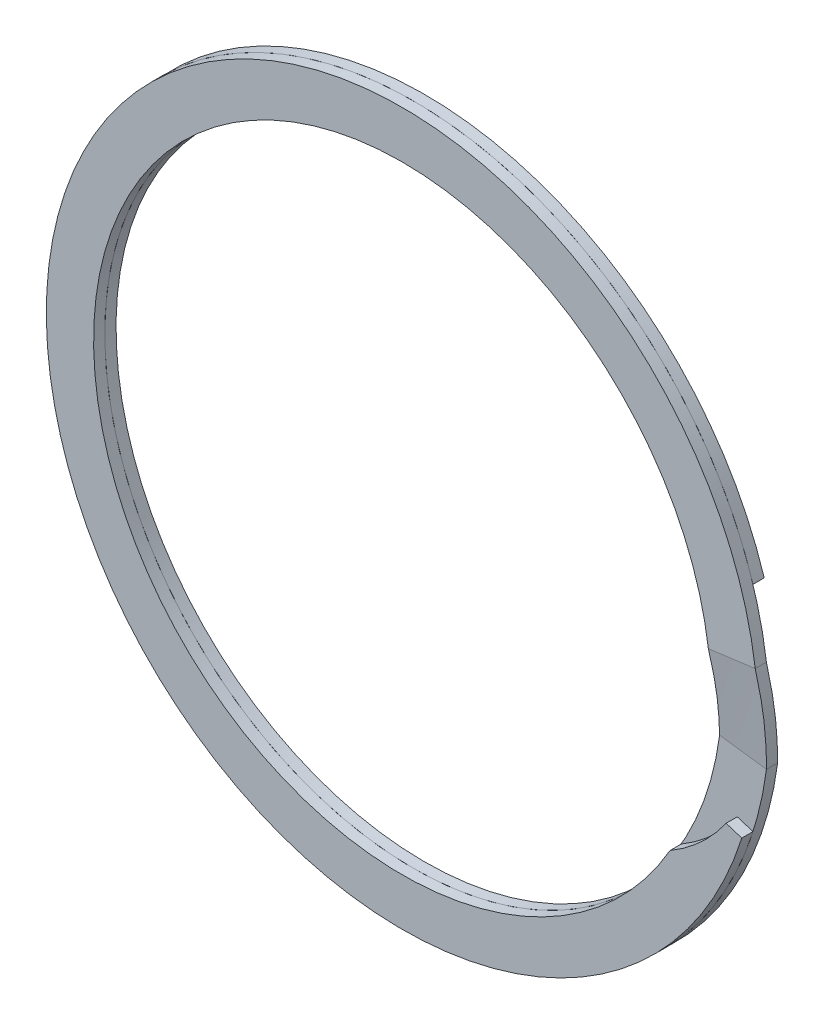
ISO-10303-21;
HEADER;
FILE_DESCRIPTION(('STEP AP214'),'2;1');
FILE_NAME('part.step','',(''),(''),'','','');
FILE_SCHEMA(('AUTOMOTIVE_DESIGN { 1 0 10303 214 1 1 1 1 }'));
ENDSEC;
DATA;
#1=APPLICATION_CONTEXT('core data for automotive mechanical design processes');
#2=APPLICATION_PROTOCOL_DEFINITION('international standard','automotive_design',2000,#1);
#3=PRODUCT_CONTEXT('',#1,'mechanical');
#4=PRODUCT('Part','Part','',(#3));
#5=PRODUCT_RELATED_PRODUCT_CATEGORY('part','',(#4));
#6=PRODUCT_DEFINITION_FORMATION('','',#4);
#7=PRODUCT_DEFINITION_CONTEXT('part definition',#1,'design');
#8=PRODUCT_DEFINITION('design','',#6,#7);
#9=PRODUCT_DEFINITION_SHAPE('','',#8);
#10=(LENGTH_UNIT() NAMED_UNIT(*) SI_UNIT(.MILLI.,.METRE.));
#11=(NAMED_UNIT(*) PLANE_ANGLE_UNIT() SI_UNIT($,.RADIAN.));
#12=(NAMED_UNIT(*) SI_UNIT($,.STERADIAN.) SOLID_ANGLE_UNIT());
#13=UNCERTAINTY_MEASURE_WITH_UNIT(LENGTH_MEASURE(1.E-05),#10,'distance_accuracy_value','');
#14=(GEOMETRIC_REPRESENTATION_CONTEXT(3) GLOBAL_UNCERTAINTY_ASSIGNED_CONTEXT((#13)) GLOBAL_UNIT_ASSIGNED_CONTEXT((#10,
#11,#12)) REPRESENTATION_CONTEXT('',''));
#15=CARTESIAN_POINT('',(0.,0.,0.));
#16=DIRECTION('',(0.,0.,1.));
#17=DIRECTION('',(1.,0.,0.));
#18=AXIS2_PLACEMENT_3D('',#15,#16,#17);
#19=CARTESIAN_POINT('',(32.8862260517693,4.32955379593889,-0.00254));
#20=DIRECTION('',(0.,0.,-1.));
#21=DIRECTION('',(-1.,0.,0.));
#22=AXIS2_PLACEMENT_3D('',#19,#20,#21);
#23=PLANE('',#22);
#24=CARTESIAN_POINT('',(19.125,0.,-0.00254000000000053));
#25=DIRECTION('',(0.,0.,-1.));
#26=DIRECTION('',(-1.,0.,0.));
#27=AXIS2_PLACEMENT_3D('',#24,#25,#26);
#28=CIRCLE('',#27,19.125);
#29=CARTESIAN_POINT('',(34.7912828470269,10.9696493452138,-0.00254000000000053));
#30=VERTEX_POINT('',#29);
#31=CARTESIAN_POINT('',(28.764677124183,16.5179372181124,-0.00254));
#32=VERTEX_POINT('',#31);
#33=EDGE_CURVE('E111',#30,#32,#28,.F.);
#34=ORIENTED_EDGE('',*,*,#33,.F.);
#35=DIRECTION('',(-0.953716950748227,-0.300705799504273,0.));
#36=VECTOR('',#35,1.);
#37=CARTESIAN_POINT('',(34.7912828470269,10.9696493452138,-0.00254000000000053));
#38=LINE('',#37,#36);
#39=CARTESIAN_POINT('',(36.4796733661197,11.5019968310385,-0.00254000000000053));
#40=VERTEX_POINT('',#39);
#41=EDGE_CURVE('E419',#40,#30,#38,.T.);
#42=ORIENTED_EDGE('',*,*,#41,.F.);
#43=CARTESIAN_POINT('',(0.,0.,-0.00254));
#44=DIRECTION('',(0.,0.,1.));
#45=DIRECTION('',(1.,0.,0.));
#46=AXIS2_PLACEMENT_3D('',#43,#44,#45);
#47=CIRCLE('',#46,38.25);
#48=CARTESIAN_POINT('',(37.9227659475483,-4.99262685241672,-0.00254));
#49=VERTEX_POINT('',#48);
#50=EDGE_CURVE('E14',#40,#49,#47,.T.);
#51=ORIENTED_EDGE('',*,*,#50,.T.);
#52=CARTESIAN_POINT('',(32.8862260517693,-4.32955379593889,-0.00254));
#53=CARTESIAN_POINT('',(34.5650726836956,-4.55057814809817,-0.00254));
#54=CARTESIAN_POINT('',(36.243919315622,-4.77160250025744,-0.00254));
#55=CARTESIAN_POINT('',(37.9227659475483,-4.99262685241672,-0.00254));
#56=B_SPLINE_CURVE_WITH_KNOTS('',3,(#52,#53,#54,#55),.UNSPECIFIED.,.F.,.F.,(4,4),(0.,1.),.UNSPECIFIED.);
#57=CARTESIAN_POINT('',(32.8862260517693,-4.32955379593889,-0.00254));
#58=VERTEX_POINT('',#57);
#59=EDGE_CURVE('E241',#49,#58,#56,.F.);
#60=ORIENTED_EDGE('',*,*,#59,.T.);
#61=CARTESIAN_POINT('',(0.,0.,-0.00254));
#62=DIRECTION('',(0.,0.,1.));
#63=DIRECTION('',(1.,0.,0.));
#64=AXIS2_PLACEMENT_3D('',#61,#62,#63);
#65=CIRCLE('',#64,33.17);
#66=EDGE_CURVE('E172',#32,#58,#65,.T.);
#67=ORIENTED_EDGE('',*,*,#66,.F.);
#68=EDGE_LOOP('',(#34,#42,#51,#60,#67));
#69=FACE_BOUND('',#68,.T.);
#70=ADVANCED_FACE('F94',(#69),#23,.F.);
#71=CARTESIAN_POINT('',(0.,0.,0.));
#72=DIRECTION('',(0.,0.,1.));
#73=DIRECTION('',(1.,0.,0.));
#74=AXIS2_PLACEMENT_3D('',#71,#72,#73);
#75=CYLINDRICAL_SURFACE('',#74,38.25);
#76=ORIENTED_EDGE('',*,*,#50,.F.);
#77=DIRECTION('',(0.,0.,-1.));
#78=VECTOR('',#77,1.);
#79=CARTESIAN_POINT('',(36.4796733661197,11.5019968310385,15.2430259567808));
#80=LINE('',#79,#78);
#81=CARTESIAN_POINT('',(36.4796733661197,11.5019968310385,-1.205));
#82=VERTEX_POINT('',#81);
#83=EDGE_CURVE('E422',#40,#82,#80,.T.);
#84=ORIENTED_EDGE('',*,*,#83,.T.);
#85=CARTESIAN_POINT('',(0.,0.,-1.205));
#86=DIRECTION('',(0.,0.,1.));
#87=DIRECTION('',(1.,0.,0.));
#88=AXIS2_PLACEMENT_3D('',#85,#86,#87);
#89=CIRCLE('',#88,38.25);
#90=CARTESIAN_POINT('',(37.9227659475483,-4.99262685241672,-1.205));
#91=VERTEX_POINT('',#90);
#92=EDGE_CURVE('E104',#82,#91,#89,.T.);
#93=ORIENTED_EDGE('',*,*,#92,.T.);
#94=CARTESIAN_POINT('',(37.9227659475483,-4.99262685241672,-0.00254));
#95=CARTESIAN_POINT('',(37.9227659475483,-4.99262685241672,-0.102745));
#96=CARTESIAN_POINT('',(37.9227659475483,-4.99262685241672,-0.303155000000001));
#97=CARTESIAN_POINT('',(37.9227659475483,-4.99262685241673,-0.603769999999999));
#98=CARTESIAN_POINT('',(37.9227659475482,-4.99262685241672,-0.904385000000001));
#99=CARTESIAN_POINT('',(37.9227659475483,-4.99262685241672,-1.104795));
#100=CARTESIAN_POINT('',(37.9227659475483,-4.99262685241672,-1.205));
#101=B_SPLINE_CURVE_WITH_KNOTS('',3,(#94,#95,#96,#97,#98,#99,#100),.UNSPECIFIED.,.F.,.F.,(4,1,1,
1,4),(0.839348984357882,0.879511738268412,0.919674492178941,0.959837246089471,1.),.UNSPECIFIED.);
#102=EDGE_CURVE('E174',#91,#49,#101,.F.);
#103=ORIENTED_EDGE('',*,*,#102,.T.);
#104=EDGE_LOOP('',(#76,#84,#93,#103));
#105=FACE_BOUND('',#104,.T.);
#106=ADVANCED_FACE('F96',(#105),#75,.T.);
#107=CARTESIAN_POINT('',(32.8862260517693,4.32955379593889,-1.205));
#108=DIRECTION('',(0.,0.,1.));
#109=DIRECTION('',(1.,0.,0.));
#110=AXIS2_PLACEMENT_3D('',#107,#108,#109);
#111=PLANE('',#110);
#112=ORIENTED_EDGE('',*,*,#92,.F.);
#113=DIRECTION('',(0.953716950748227,0.300705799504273,0.));
#114=VECTOR('',#113,1.);
#115=CARTESIAN_POINT('',(34.7912828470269,10.9696493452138,-1.205));
#116=LINE('',#115,#114);
#117=CARTESIAN_POINT('',(34.7912828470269,10.9696493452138,-1.205));
#118=VERTEX_POINT('',#117);
#119=EDGE_CURVE('E162',#118,#82,#116,.T.);
#120=ORIENTED_EDGE('',*,*,#119,.F.);
#121=CARTESIAN_POINT('',(19.125,0.,-1.205));
#122=DIRECTION('',(0.,0.,-1.));
#123=DIRECTION('',(-1.,0.,0.));
#124=AXIS2_PLACEMENT_3D('',#121,#122,#123);
#125=CIRCLE('',#124,19.125);
#126=CARTESIAN_POINT('',(28.764677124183,16.5179372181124,-1.205));
#127=VERTEX_POINT('',#126);
#128=EDGE_CURVE('E157',#127,#118,#125,.T.);
#129=ORIENTED_EDGE('',*,*,#128,.F.);
#130=CARTESIAN_POINT('',(0.,0.,-1.205));
#131=DIRECTION('',(0.,0.,1.));
#132=DIRECTION('',(1.,0.,0.));
#133=AXIS2_PLACEMENT_3D('',#130,#131,#132);
#134=CIRCLE('',#133,33.17);
#135=CARTESIAN_POINT('',(32.8862260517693,-4.32955379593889,-1.205));
#136=VERTEX_POINT('',#135);
#137=EDGE_CURVE('E119',#127,#136,#134,.T.);
#138=ORIENTED_EDGE('',*,*,#137,.T.);
#139=CARTESIAN_POINT('',(37.9227659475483,-4.99262685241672,-1.205));
#140=CARTESIAN_POINT('',(37.5030542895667,-4.9373707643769,-1.205));
#141=CARTESIAN_POINT('',(36.6636309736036,-4.82685858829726,-1.205));
#142=CARTESIAN_POINT('',(35.4044959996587,-4.6610903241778,-1.205));
#143=CARTESIAN_POINT('',(34.1453610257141,-4.49532206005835,-1.205));
#144=CARTESIAN_POINT('',(33.3059377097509,-4.38480988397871,-1.205));
#145=CARTESIAN_POINT('',(32.8862260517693,-4.32955379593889,-1.205));
#146=B_SPLINE_CURVE_WITH_KNOTS('',3,(#139,#140,#141,#142,#143,#144,#145),.UNSPECIFIED.,.F.,.F.,
(4,1,1,1,4),(0.160651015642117,0.330325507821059,0.5,0.669674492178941,0.839348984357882),.UNSPECIFIED.);
#147=EDGE_CURVE('E214',#136,#91,#146,.F.);
#148=ORIENTED_EDGE('',*,*,#147,.T.);
#149=EDGE_LOOP('',(#112,#120,#129,#138,#148));
#150=FACE_BOUND('',#149,.T.);
#151=ADVANCED_FACE('F165',(#150),#111,.F.);
#152=CARTESIAN_POINT('',(0.,0.,0.));
#153=DIRECTION('',(0.,0.,1.));
#154=DIRECTION('',(1.,0.,0.));
#155=AXIS2_PLACEMENT_3D('',#152,#153,#154);
#156=CYLINDRICAL_SURFACE('',#155,33.17);
#157=ORIENTED_EDGE('',*,*,#137,.F.);
#158=DIRECTION('',(0.,0.,-1.));
#159=VECTOR('',#158,1.);
#160=CARTESIAN_POINT('',(28.764677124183,16.5179372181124,15.2430259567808));
#161=LINE('',#160,#159);
#162=EDGE_CURVE('E155',#32,#127,#161,.T.);
#163=ORIENTED_EDGE('',*,*,#162,.F.);
#164=ORIENTED_EDGE('',*,*,#66,.T.);
#165=CARTESIAN_POINT('',(32.8862260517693,-4.32955379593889,-1.205));
#166=CARTESIAN_POINT('',(32.8862260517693,-4.32955379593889,-1.104795));
#167=CARTESIAN_POINT('',(32.8862260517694,-4.32955379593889,-0.904385));
#168=CARTESIAN_POINT('',(32.8862260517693,-4.32955379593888,-0.60377));
#169=CARTESIAN_POINT('',(32.8862260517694,-4.3295537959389,-0.303155));
#170=CARTESIAN_POINT('',(32.8862260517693,-4.32955379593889,-0.102745));
#171=CARTESIAN_POINT('',(32.8862260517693,-4.32955379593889,-0.00254000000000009));
#172=B_SPLINE_CURVE_WITH_KNOTS('',3,(#165,#166,#167,#168,#169,#170,#171),.UNSPECIFIED.,.F.,.F.,
(4,1,1,1,4),(0.,0.0401627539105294,0.0803255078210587,0.120488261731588,0.160651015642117),.UNSPECIFIED.);
#173=EDGE_CURVE('E170',#58,#136,#172,.F.);
#174=ORIENTED_EDGE('',*,*,#173,.T.);
#175=EDGE_LOOP('',(#157,#163,#164,#174));
#176=FACE_BOUND('',#175,.T.);
#177=ADVANCED_FACE('F168',(#176),#156,.F.);
#178=CARTESIAN_POINT('',(0.,0.,0.));
#179=DIRECTION('',(0.130526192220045,-0.991444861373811,0.));
#180=DIRECTION('',(0.991444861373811,0.130526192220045,0.));
#181=AXIS2_PLACEMENT_3D('',#178,#179,#180);
#182=PLANE('',#181);
#183=DIRECTION('',(-0.991444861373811,-0.130526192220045,0.));
#184=VECTOR('',#183,1.);
#185=CARTESIAN_POINT('',(37.9227659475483,4.99262685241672,1.205));
#186=LINE('',#185,#184);
#187=CARTESIAN_POINT('',(37.9227659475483,4.99262685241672,1.205));
#188=VERTEX_POINT('',#187);
#189=CARTESIAN_POINT('',(32.8862260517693,4.32955379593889,1.205));
#190=VERTEX_POINT('',#189);
#191=EDGE_CURVE('E271',#188,#190,#186,.T.);
#192=ORIENTED_EDGE('',*,*,#191,.F.);
#193=DIRECTION('',(0.,0.,1.));
#194=VECTOR('',#193,1.);
#195=CARTESIAN_POINT('',(37.9227659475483,4.99262685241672,0.00254));
#196=LINE('',#195,#194);
#197=CARTESIAN_POINT('',(37.9227659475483,4.99262685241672,0.00254));
#198=VERTEX_POINT('',#197);
#199=EDGE_CURVE('E247',#198,#188,#196,.T.);
#200=ORIENTED_EDGE('',*,*,#199,.F.);
#201=DIRECTION('',(0.991444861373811,0.130526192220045,0.));
#202=VECTOR('',#201,1.);
#203=CARTESIAN_POINT('',(32.8862260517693,4.32955379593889,0.00254));
#204=LINE('',#203,#202);
#205=CARTESIAN_POINT('',(32.8862260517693,4.32955379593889,0.00254));
#206=VERTEX_POINT('',#205);
#207=EDGE_CURVE('E249',#206,#198,#204,.T.);
#208=ORIENTED_EDGE('',*,*,#207,.F.);
#209=DIRECTION('',(0.,0.,-1.));
#210=VECTOR('',#209,1.);
#211=CARTESIAN_POINT('',(32.8862260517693,4.32955379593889,1.205));
#212=LINE('',#211,#210);
#213=EDGE_CURVE('E256',#190,#206,#212,.T.);
#214=ORIENTED_EDGE('',*,*,#213,.F.);
#215=EDGE_LOOP('',(#192,#200,#208,#214));
#216=FACE_BOUND('',#215,.T.);
#217=ADVANCED_FACE('F200',(#216),#182,.F.);
#218=CARTESIAN_POINT('',(37.9227659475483,4.99262685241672,1.205));
#219=CARTESIAN_POINT('',(38.0160419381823,4.1617114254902,1.10425550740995));
#220=CARTESIAN_POINT('',(38.2951498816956,1.67537925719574,0.802799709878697));
#221=CARTESIAN_POINT('',(38.2856092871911,-1.67350909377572,0.405008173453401));
#222=CARTESIAN_POINT('',(38.0212876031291,-4.16211062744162,0.0999050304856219));
#223=CARTESIAN_POINT('',(37.9227659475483,-4.99262685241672,-0.00254));
#224=CARTESIAN_POINT('',(36.243919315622,4.77160250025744,1.205));
#225=CARTESIAN_POINT('',(36.3345737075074,3.97769016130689,1.10425597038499));
#226=CARTESIAN_POINT('',(36.5971028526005,1.60078252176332,0.803053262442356));
#227=CARTESIAN_POINT('',(36.593484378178,-1.59991185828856,0.405313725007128));
#228=CARTESIAN_POINT('',(36.3365694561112,-3.97764766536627,0.0998731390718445));
#229=CARTESIAN_POINT('',(36.243919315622,-4.77160250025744,-0.00254));
#230=CARTESIAN_POINT('',(34.5650726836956,4.55057814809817,1.205));
#231=CARTESIAN_POINT('',(34.6531054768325,3.79366889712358,1.10425643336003));
#232=CARTESIAN_POINT('',(34.8990558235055,1.52618578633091,0.803306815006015));
#233=CARTESIAN_POINT('',(34.9013594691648,-1.5263146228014,0.405619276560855));
#234=CARTESIAN_POINT('',(34.6518513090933,-3.79318470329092,0.0998412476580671));
#235=CARTESIAN_POINT('',(34.5650726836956,-4.55057814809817,-0.00254));
#236=CARTESIAN_POINT('',(32.8862260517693,4.32955379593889,1.205));
#237=CARTESIAN_POINT('',(32.9716372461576,3.60964763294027,1.10425689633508));
#238=CARTESIAN_POINT('',(33.2010087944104,1.45158905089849,0.803560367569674));
#239=CARTESIAN_POINT('',(33.2092345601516,-1.45271738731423,0.405924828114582));
#240=CARTESIAN_POINT('',(32.9671331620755,-3.60872174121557,0.0998093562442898));
#241=CARTESIAN_POINT('',(32.8862260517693,-4.32955379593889,-0.00254));
#242=B_SPLINE_SURFACE_WITH_KNOTS('',3,3,((#218,#219,#220,#221,#222,#223),(#224,#225,#226,#227,
#228,#229),(#230,#231,#232,#233,#234,#235),(#236,#237,#238,#239,#240,#241)),.UNSPECIFIED.,.F.,
.F.,.F.,(4,4),(4,1,1,4),(0.,1.),(0.,0.250441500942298,0.749391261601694,1.),.UNSPECIFIED.);
#243=CARTESIAN_POINT('',(32.8862260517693,4.32955379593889,1.205));
#244=CARTESIAN_POINT('',(32.9716372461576,3.60964763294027,1.10425689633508));
#245=CARTESIAN_POINT('',(33.2010087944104,1.45158905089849,0.803560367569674));
#246=CARTESIAN_POINT('',(33.2092345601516,-1.45271738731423,0.405924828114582));
#247=CARTESIAN_POINT('',(32.9671331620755,-3.60872174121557,0.0998093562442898));
#248=CARTESIAN_POINT('',(32.8862260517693,-4.32955379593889,-0.00254));
#249=B_SPLINE_CURVE_WITH_KNOTS('',3,(#243,#244,#245,#246,#247,#248),.UNSPECIFIED.,.F.,.F.,(4,1,
1,4),(0.,0.250441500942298,0.749391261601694,1.),.UNSPECIFIED.);
#250=EDGE_CURVE('E274',#190,#58,#249,.T.);
#251=CARTESIAN_POINT('',(37.9227659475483,4.99262685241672,1.205));
#252=CARTESIAN_POINT('',(38.0160419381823,4.1617114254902,1.10425550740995));
#253=CARTESIAN_POINT('',(38.2951498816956,1.67537925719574,0.802799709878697));
#254=CARTESIAN_POINT('',(38.2856092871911,-1.67350909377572,0.405008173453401));
#255=CARTESIAN_POINT('',(38.0212876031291,-4.16211062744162,0.0999050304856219));
#256=CARTESIAN_POINT('',(37.9227659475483,-4.99262685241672,-0.00254));
#257=B_SPLINE_CURVE_WITH_KNOTS('',3,(#251,#252,#253,#254,#255,#256),.UNSPECIFIED.,.F.,.F.,(4,1,
1,4),(0.,0.250441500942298,0.749391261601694,1.),.UNSPECIFIED.);
#258=EDGE_CURVE('E315',#49,#188,#257,.F.);
#259=ORIENTED_EDGE('',*,*,#191,.T.);
#260=ORIENTED_EDGE('',*,*,#250,.T.);
#261=ORIENTED_EDGE('',*,*,#59,.F.);
#262=ORIENTED_EDGE('',*,*,#258,.T.);
#263=EDGE_LOOP('',(#259,#260,#261,#262));
#264=FACE_BOUND('',#263,.T.);
#265=ADVANCED_FACE('F289',(#264),#242,.T.);
#266=CARTESIAN_POINT('',(37.9227659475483,4.99262685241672,0.00254));
#267=CARTESIAN_POINT('',(38.0147784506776,4.16175992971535,-0.0982042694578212));
#268=CARTESIAN_POINT('',(38.285896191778,1.67494679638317,-0.399538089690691));
#269=CARTESIAN_POINT('',(38.2792097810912,-1.67353459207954,-0.797304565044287));
#270=CARTESIAN_POINT('',(38.0184578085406,-4.16193437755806,-1.10257033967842));
#271=CARTESIAN_POINT('',(37.9227659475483,-4.99262685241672,-1.205));
#272=CARTESIAN_POINT('',(37.9227659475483,4.99262685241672,0.102745));
#273=CARTESIAN_POINT('',(38.014883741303,4.16175588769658,0.00200071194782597));
#274=CARTESIAN_POINT('',(38.2866673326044,1.67498283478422,-0.299343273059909));
#275=CARTESIAN_POINT('',(38.2797430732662,-1.67353246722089,-0.697111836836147));
#276=CARTESIAN_POINT('',(38.0186936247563,-4.16194906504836,-1.00236405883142));
#277=CARTESIAN_POINT('',(37.9227659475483,-4.99262685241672,-1.104795));
#278=CARTESIAN_POINT('',(37.9227659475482,4.99262685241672,0.303155));
#279=CARTESIAN_POINT('',(38.0150943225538,4.16174780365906,0.202410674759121));
#280=CARTESIAN_POINT('',(38.2882096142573,1.67505491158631,-0.0989536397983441));
#281=CARTESIAN_POINT('',(38.2808096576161,-1.67352821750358,-0.496726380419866));
#282=CARTESIAN_POINT('',(38.0191652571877,-4.16197844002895,-0.80195149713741));
#283=CARTESIAN_POINT('',(37.9227659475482,-4.99262685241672,-0.904385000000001));
#284=CARTESIAN_POINT('',(37.9227659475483,4.99262685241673,0.603769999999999));
#285=CARTESIAN_POINT('',(38.01541019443,4.16173567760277,0.503025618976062));
#286=CARTESIAN_POINT('',(38.2905230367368,1.67516302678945,0.201630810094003));
#287=CARTESIAN_POINT('',(38.2824095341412,-1.67352184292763,-0.196148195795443));
#288=CARTESIAN_POINT('',(38.0198727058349,-4.16202250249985,-0.501332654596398));
#289=CARTESIAN_POINT('',(37.9227659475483,-4.99262685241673,-0.603769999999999));
#290=CARTESIAN_POINT('',(37.9227659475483,4.99262685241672,0.904385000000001));
#291=CARTESIAN_POINT('',(38.0157260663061,4.16172355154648,0.803640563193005));
#292=CARTESIAN_POINT('',(38.2928364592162,1.67527114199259,0.502215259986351));
#293=CARTESIAN_POINT('',(38.2840094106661,-1.67351546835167,0.104429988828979));
#294=CARTESIAN_POINT('',(38.0205801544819,-4.16206656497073,-0.200713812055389));
#295=CARTESIAN_POINT('',(37.9227659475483,-4.99262685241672,-0.303155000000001));
#296=CARTESIAN_POINT('',(37.9227659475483,4.99262685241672,1.104795));
#297=CARTESIAN_POINT('',(38.0159366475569,4.16171546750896,1.0040505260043));
#298=CARTESIAN_POINT('',(38.2943787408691,1.67534321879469,0.702604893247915));
#299=CARTESIAN_POINT('',(38.2850759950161,-1.67351121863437,0.304815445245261));
#300=CARTESIAN_POINT('',(38.0210517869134,-4.16209593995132,-0.000301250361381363));
#301=CARTESIAN_POINT('',(37.9227659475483,-4.99262685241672,-0.102745));
#302=CARTESIAN_POINT('',(37.9227659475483,4.99262685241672,1.205));
#303=CARTESIAN_POINT('',(38.0160419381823,4.1617114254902,1.10425550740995));
#304=CARTESIAN_POINT('',(38.2951498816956,1.67537925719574,0.802799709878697));
#305=CARTESIAN_POINT('',(38.2856092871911,-1.67350909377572,0.405008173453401));
#306=CARTESIAN_POINT('',(38.0212876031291,-4.16211062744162,0.0999050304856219));
#307=CARTESIAN_POINT('',(37.9227659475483,-4.99262685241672,-0.00254));
#308=B_SPLINE_SURFACE_WITH_KNOTS('',3,3,((#266,#267,#268,#269,#270,#271),(#272,#273,#274,#275,
#276,#277),(#278,#279,#280,#281,#282,#283),(#284,#285,#286,#287,#288,#289),(#290,#291,#292,#293,
#294,#295),(#296,#297,#298,#299,#300,#301),(#302,#303,#304,#305,#306,#307)),.UNSPECIFIED.,.F.,
.F.,.F.,(4,1,1,1,4),(4,1,1,4),(0.839348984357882,0.879511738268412,0.919674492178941,
0.959837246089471,1.),(0.,0.250441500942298,0.749391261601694,1.),.UNSPECIFIED.);
#309=CARTESIAN_POINT('',(37.9227659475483,4.99262685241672,0.00254));
#310=CARTESIAN_POINT('',(38.0147784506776,4.16175992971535,-0.0982042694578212));
#311=CARTESIAN_POINT('',(38.285896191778,1.67494679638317,-0.399538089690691));
#312=CARTESIAN_POINT('',(38.2792097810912,-1.67353459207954,-0.797304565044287));
#313=CARTESIAN_POINT('',(38.0184578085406,-4.16193437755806,-1.10257033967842));
#314=CARTESIAN_POINT('',(37.9227659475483,-4.99262685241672,-1.205));
#315=B_SPLINE_CURVE_WITH_KNOTS('',3,(#309,#310,#311,#312,#313,#314),.UNSPECIFIED.,.F.,.F.,(4,1,
1,4),(0.,0.250441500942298,0.749391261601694,1.),.UNSPECIFIED.);
#316=EDGE_CURVE('E324',#198,#91,#315,.T.);
#317=ORIENTED_EDGE('',*,*,#199,.T.);
#318=ORIENTED_EDGE('',*,*,#258,.F.);
#319=ORIENTED_EDGE('',*,*,#102,.F.);
#320=ORIENTED_EDGE('',*,*,#316,.F.);
#321=EDGE_LOOP('',(#317,#318,#319,#320));
#322=FACE_BOUND('',#321,.T.);
#323=ADVANCED_FACE('F375',(#322),#308,.T.);
#324=CARTESIAN_POINT('',(32.8862260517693,4.32955379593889,0.00254));
#325=CARTESIAN_POINT('',(32.9729007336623,3.60959912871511,-0.0982033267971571));
#326=CARTESIAN_POINT('',(33.2102624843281,1.45202151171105,-0.399021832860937));
#327=CARTESIAN_POINT('',(33.2156340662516,-1.45269188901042,-0.79668243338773));
#328=CARTESIAN_POINT('',(32.9699629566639,-3.60889799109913,-1.10263527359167));
#329=CARTESIAN_POINT('',(32.8862260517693,-4.32955379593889,-1.205));
#330=CARTESIAN_POINT('',(33.3059377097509,4.38480988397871,0.00254));
#331=CARTESIAN_POINT('',(33.3930572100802,3.65561252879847,-0.0982034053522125));
#332=CARTESIAN_POINT('',(33.6332319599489,1.47059861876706,-0.399064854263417));
#333=CARTESIAN_POINT('',(33.6375987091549,-1.47109544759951,-0.796734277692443));
#334=CARTESIAN_POINT('',(33.390670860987,-3.65498435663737,-1.10262986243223));
#335=CARTESIAN_POINT('',(33.3059377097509,-4.38480988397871,-1.205));
#336=CARTESIAN_POINT('',(34.1453610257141,4.49532206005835,0.00254));
#337=CARTESIAN_POINT('',(34.2333701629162,3.74763932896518,-0.0982035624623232));
#338=CARTESIAN_POINT('',(34.4791709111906,1.50775283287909,-0.399150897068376));
#339=CARTESIAN_POINT('',(34.4815279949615,-1.5079025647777,-0.79683796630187));
#340=CARTESIAN_POINT('',(34.2320866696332,-3.74715708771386,-1.10261904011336));
#341=CARTESIAN_POINT('',(34.1453610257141,-4.49532206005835,-1.205));
#342=CARTESIAN_POINT('',(35.4044959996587,4.6610903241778,0.00254));
#343=CARTESIAN_POINT('',(35.4938395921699,3.88567952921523,-0.0982037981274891));
#344=CARTESIAN_POINT('',(35.7480793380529,1.56348415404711,-0.399279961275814));
#345=CARTESIAN_POINT('',(35.7474219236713,-1.56311324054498,-0.796993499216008));
#346=CARTESIAN_POINT('',(35.4942103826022,-3.88541618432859,-1.10260280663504));
#347=CARTESIAN_POINT('',(35.4044959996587,-4.6610903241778,-1.205));
#348=CARTESIAN_POINT('',(36.6636309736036,4.82685858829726,0.00254));
#349=CARTESIAN_POINT('',(36.7543090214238,4.02371972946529,-0.0982040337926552));
#350=CARTESIAN_POINT('',(37.0169877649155,1.61921547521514,-0.399409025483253));
#351=CARTESIAN_POINT('',(37.0133158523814,-1.61832391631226,-0.797149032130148));
#352=CARTESIAN_POINT('',(36.7563340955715,-4.02367528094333,-1.10258657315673));
#353=CARTESIAN_POINT('',(36.6636309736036,-4.82685858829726,-1.205));
#354=CARTESIAN_POINT('',(37.5030542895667,4.9373707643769,0.00254));
#355=CARTESIAN_POINT('',(37.5946219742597,4.11574652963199,-0.0982041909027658));
#356=CARTESIAN_POINT('',(37.8629267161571,1.65636968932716,-0.399495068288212));
#357=CARTESIAN_POINT('',(37.8572451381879,-1.65513103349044,-0.797252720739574));
#358=CARTESIAN_POINT('',(37.5977499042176,-4.11584801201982,-1.10257575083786));
#359=CARTESIAN_POINT('',(37.5030542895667,-4.9373707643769,-1.205));
#360=CARTESIAN_POINT('',(37.9227659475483,4.99262685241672,0.00254));
#361=CARTESIAN_POINT('',(38.0147784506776,4.16175992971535,-0.0982042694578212));
#362=CARTESIAN_POINT('',(38.285896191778,1.67494679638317,-0.399538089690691));
#363=CARTESIAN_POINT('',(38.2792097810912,-1.67353459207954,-0.797304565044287));
#364=CARTESIAN_POINT('',(38.0184578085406,-4.16193437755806,-1.10257033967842));
#365=CARTESIAN_POINT('',(37.9227659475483,-4.99262685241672,-1.205));
#366=B_SPLINE_SURFACE_WITH_KNOTS('',3,3,((#324,#325,#326,#327,#328,#329),(#330,#331,#332,#333,
#334,#335),(#336,#337,#338,#339,#340,#341),(#342,#343,#344,#345,#346,#347),(#348,#349,#350,#351,
#352,#353),(#354,#355,#356,#357,#358,#359),(#360,#361,#362,#363,#364,#365)),.UNSPECIFIED.,.F.,
.F.,.F.,(4,1,1,1,4),(4,1,1,4),(0.160651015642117,0.330325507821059,0.5,0.669674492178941,
0.839348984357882),(0.,0.250441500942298,0.749391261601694,1.),.UNSPECIFIED.);
#367=CARTESIAN_POINT('',(32.8862260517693,4.32955379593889,0.00254));
#368=CARTESIAN_POINT('',(32.9729007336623,3.60959912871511,-0.0982033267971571));
#369=CARTESIAN_POINT('',(33.2102624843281,1.45202151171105,-0.399021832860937));
#370=CARTESIAN_POINT('',(33.2156340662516,-1.45269188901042,-0.79668243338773));
#371=CARTESIAN_POINT('',(32.9699629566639,-3.60889799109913,-1.10263527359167));
#372=CARTESIAN_POINT('',(32.8862260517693,-4.32955379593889,-1.205));
#373=B_SPLINE_CURVE_WITH_KNOTS('',3,(#367,#368,#369,#370,#371,#372),.UNSPECIFIED.,.F.,.F.,(4,1,
1,4),(0.,0.250441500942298,0.749391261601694,1.),.UNSPECIFIED.);
#374=EDGE_CURVE('E339',#206,#136,#373,.T.);
#375=ORIENTED_EDGE('',*,*,#207,.T.);
#376=ORIENTED_EDGE('',*,*,#316,.T.);
#377=ORIENTED_EDGE('',*,*,#147,.F.);
#378=ORIENTED_EDGE('',*,*,#374,.F.);
#379=EDGE_LOOP('',(#375,#376,#377,#378));
#380=FACE_BOUND('',#379,.T.);
#381=ADVANCED_FACE('F351',(#380),#366,.T.);
#382=CARTESIAN_POINT('',(32.8862260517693,4.32955379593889,1.205));
#383=CARTESIAN_POINT('',(32.9716372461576,3.60964763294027,1.10425689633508));
#384=CARTESIAN_POINT('',(33.2010087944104,1.45158905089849,0.803560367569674));
#385=CARTESIAN_POINT('',(33.2092345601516,-1.45271738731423,0.405924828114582));
#386=CARTESIAN_POINT('',(32.9671331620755,-3.60872174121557,0.0998093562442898));
#387=CARTESIAN_POINT('',(32.8862260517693,-4.32955379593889,-0.00254000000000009));
#388=CARTESIAN_POINT('',(32.8862260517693,4.32955379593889,1.104795));
#389=CARTESIAN_POINT('',(32.971742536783,3.6096435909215,1.00405187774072));
#390=CARTESIAN_POINT('',(33.2017799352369,1.45162508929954,0.703345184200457));
#391=CARTESIAN_POINT('',(33.2097678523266,-1.45271526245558,0.305707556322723));
#392=CARTESIAN_POINT('',(32.9673689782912,-3.60873642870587,-0.000394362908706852));
#393=CARTESIAN_POINT('',(32.8862260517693,-4.32955379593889,-0.102745));
#394=CARTESIAN_POINT('',(32.8862260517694,4.3295537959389,0.904385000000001));
#395=CARTESIAN_POINT('',(32.9719531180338,3.60963550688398,0.803641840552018));
#396=CARTESIAN_POINT('',(33.2033222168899,1.45169716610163,0.502914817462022));
#397=CARTESIAN_POINT('',(33.2108344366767,-1.45271101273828,0.105273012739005));
#398=CARTESIAN_POINT('',(32.9678406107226,-3.60876580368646,-0.2008018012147));
#399=CARTESIAN_POINT('',(32.8862260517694,-4.3295537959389,-0.303155));
#400=CARTESIAN_POINT('',(32.8862260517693,4.32955379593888,0.603769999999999));
#401=CARTESIAN_POINT('',(32.9722689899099,3.60962338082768,0.503026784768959));
#402=CARTESIAN_POINT('',(33.2056356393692,1.45180528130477,0.202269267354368));
#403=CARTESIAN_POINT('',(33.2124343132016,-1.45270463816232,-0.195378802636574));
#404=CARTESIAN_POINT('',(32.9685480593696,-3.60880986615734,-0.50141295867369));
#405=CARTESIAN_POINT('',(32.8862260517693,-4.32955379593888,-0.60377));
#406=CARTESIAN_POINT('',(32.8862260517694,4.32955379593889,0.303155));
#407=CARTESIAN_POINT('',(32.9725848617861,3.60961125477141,0.202411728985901));
#408=CARTESIAN_POINT('',(33.2079490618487,1.45191339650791,-0.0983762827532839));
#409=CARTESIAN_POINT('',(33.2140341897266,-1.45269826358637,-0.496030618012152));
#410=CARTESIAN_POINT('',(32.9692555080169,-3.60885392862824,-0.802024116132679));
#411=CARTESIAN_POINT('',(32.8862260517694,-4.32955379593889,-0.904385));
#412=CARTESIAN_POINT('',(32.8862260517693,4.32955379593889,0.102745));
#413=CARTESIAN_POINT('',(32.9727954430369,3.60960317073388,0.00200169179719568));
#414=CARTESIAN_POINT('',(33.2094913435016,1.45198547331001,-0.298806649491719));
#415=CARTESIAN_POINT('',(33.2151007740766,-1.45269401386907,-0.69646516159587));
#416=CARTESIAN_POINT('',(32.9697271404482,-3.60888330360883,-1.00243155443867));
#417=CARTESIAN_POINT('',(32.8862260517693,-4.32955379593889,-1.104795));
#418=CARTESIAN_POINT('',(32.8862260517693,4.32955379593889,0.00254));
#419=CARTESIAN_POINT('',(32.9729007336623,3.60959912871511,-0.0982033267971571));
#420=CARTESIAN_POINT('',(33.2102624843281,1.45202151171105,-0.399021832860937));
#421=CARTESIAN_POINT('',(33.2156340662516,-1.45269188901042,-0.79668243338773));
#422=CARTESIAN_POINT('',(32.9699629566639,-3.60889799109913,-1.10263527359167));
#423=CARTESIAN_POINT('',(32.8862260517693,-4.32955379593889,-1.205));
#424=B_SPLINE_SURFACE_WITH_KNOTS('',3,3,((#382,#383,#384,#385,#386,#387),(#388,#389,#390,#391,
#392,#393),(#394,#395,#396,#397,#398,#399),(#400,#401,#402,#403,#404,#405),(#406,#407,#408,#409,
#410,#411),(#412,#413,#414,#415,#416,#417),(#418,#419,#420,#421,#422,#423)),.UNSPECIFIED.,.F.,
.F.,.F.,(4,1,1,1,4),(4,1,1,4),(0.,0.0401627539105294,0.0803255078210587,0.120488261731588,
0.160651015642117),(0.,0.250441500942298,0.749391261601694,1.),.UNSPECIFIED.);
#425=ORIENTED_EDGE('',*,*,#213,.T.);
#426=ORIENTED_EDGE('',*,*,#374,.T.);
#427=ORIENTED_EDGE('',*,*,#173,.F.);
#428=ORIENTED_EDGE('',*,*,#250,.F.);
#429=EDGE_LOOP('',(#425,#426,#427,#428));
#430=FACE_BOUND('',#429,.T.);
#431=ADVANCED_FACE('F319',(#430),#424,.T.);
#432=CARTESIAN_POINT('',(34.7912828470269,10.9696493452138,15.2430259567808));
#433=DIRECTION('',(-0.300705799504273,0.953716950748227,0.));
#434=DIRECTION('',(-0.953716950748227,-0.300705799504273,0.));
#435=AXIS2_PLACEMENT_3D('',#432,#433,#434);
#436=PLANE('',#435);
#437=ORIENTED_EDGE('',*,*,#41,.T.);
#438=DIRECTION('',(0.,0.,-1.));
#439=VECTOR('',#438,1.);
#440=CARTESIAN_POINT('',(34.7912828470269,10.9696493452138,15.2430259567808));
#441=LINE('',#440,#439);
#442=EDGE_CURVE('E161',#30,#118,#441,.T.);
#443=ORIENTED_EDGE('',*,*,#442,.T.);
#444=ORIENTED_EDGE('',*,*,#119,.T.);
#445=ORIENTED_EDGE('',*,*,#83,.F.);
#446=EDGE_LOOP('',(#437,#443,#444,#445));
#447=FACE_BOUND('',#446,.T.);
#448=ADVANCED_FACE('F350',(#447),#436,.F.);
#449=CARTESIAN_POINT('',(19.125,0.,15.2430259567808));
#450=DIRECTION('',(0.,0.,-1.));
#451=DIRECTION('',(-1.,0.,0.));
#452=AXIS2_PLACEMENT_3D('',#449,#450,#451);
#453=CYLINDRICAL_SURFACE('',#452,19.125);
#454=ORIENTED_EDGE('',*,*,#33,.T.);
#455=ORIENTED_EDGE('',*,*,#162,.T.);
#456=ORIENTED_EDGE('',*,*,#128,.T.);
#457=ORIENTED_EDGE('',*,*,#442,.F.);
#458=EDGE_LOOP('',(#454,#455,#456,#457));
#459=FACE_BOUND('',#458,.T.);
#460=ADVANCED_FACE('F156',(#459),#453,.F.);
#461=CLOSED_SHELL('',(#70,#106,#151,#177,#217,#265,#323,#381,#431,#448,#460));
#462=MANIFOLD_SOLID_BREP('B2',#461);
#463=CARTESIAN_POINT('',(32.8862260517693,4.32955379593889,0.00254));
#464=DIRECTION('',(0.,0.,1.));
#465=DIRECTION('',(1.,0.,0.));
#466=AXIS2_PLACEMENT_3D('',#463,#464,#465);
#467=PLANE('',#466);
#468=CARTESIAN_POINT('',(0.,0.,0.00254));
#469=DIRECTION('',(0.,0.,1.));
#470=DIRECTION('',(1.,0.,0.));
#471=AXIS2_PLACEMENT_3D('',#468,#469,#470);
#472=CIRCLE('',#471,33.17);
#473=CARTESIAN_POINT('',(32.8862260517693,4.32955379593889,0.00254));
#474=VERTEX_POINT('',#473);
#475=CARTESIAN_POINT('',(28.764677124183,-16.5179372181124,0.00254));
#476=VERTEX_POINT('',#475);
#477=EDGE_CURVE('E573',#474,#476,#472,.T.);
#478=ORIENTED_EDGE('',*,*,#477,.T.);
#479=CARTESIAN_POINT('',(19.125,0.,0.00254000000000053));
#480=DIRECTION('',(0.,0.,1.));
#481=DIRECTION('',(1.,0.,0.));
#482=AXIS2_PLACEMENT_3D('',#479,#480,#481);
#483=CIRCLE('',#482,19.125);
#484=CARTESIAN_POINT('',(34.7912828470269,-10.9696493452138,0.00254000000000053));
#485=VERTEX_POINT('',#484);
#486=EDGE_CURVE('E566',#476,#485,#483,.T.);
#487=ORIENTED_EDGE('',*,*,#486,.T.);
#488=DIRECTION('',(0.953716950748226,-0.300705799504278,0.));
#489=VECTOR('',#488,1.);
#490=CARTESIAN_POINT('',(28.6708576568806,-9.03988669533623,0.00254));
#491=LINE('',#490,#489);
#492=CARTESIAN_POINT('',(36.4796733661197,-11.5019968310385,0.00254000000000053));
#493=VERTEX_POINT('',#492);
#494=EDGE_CURVE('E634',#485,#493,#491,.T.);
#495=ORIENTED_EDGE('',*,*,#494,.T.);
#496=CARTESIAN_POINT('',(0.,0.,0.00254));
#497=DIRECTION('',(0.,0.,1.));
#498=DIRECTION('',(1.,0.,0.));
#499=AXIS2_PLACEMENT_3D('',#496,#497,#498);
#500=CIRCLE('',#499,38.25);
#501=CARTESIAN_POINT('',(37.9227659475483,4.99262685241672,0.00254));
#502=VERTEX_POINT('',#501);
#503=EDGE_CURVE('E92',#502,#493,#500,.T.);
#504=ORIENTED_EDGE('',*,*,#503,.F.);
#505=DIRECTION('',(0.991444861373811,0.130526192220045,0.));
#506=VECTOR('',#505,1.);
#507=CARTESIAN_POINT('',(32.8862260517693,4.32955379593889,0.00254));
#508=LINE('',#507,#506);
#509=EDGE_CURVE('E631',#474,#502,#508,.T.);
#510=ORIENTED_EDGE('',*,*,#509,.F.);
#511=EDGE_LOOP('',(#478,#487,#495,#504,#510));
#512=FACE_BOUND('',#511,.T.);
#513=ADVANCED_FACE('F551',(#512),#467,.F.);
#514=CARTESIAN_POINT('',(0.,0.,0.));
#515=DIRECTION('',(0.,0.,1.));
#516=DIRECTION('',(1.,0.,0.));
#517=AXIS2_PLACEMENT_3D('',#514,#515,#516);
#518=CYLINDRICAL_SURFACE('',#517,38.25);
#519=ORIENTED_EDGE('',*,*,#503,.T.);
#520=DIRECTION('',(0.,0.,1.));
#521=VECTOR('',#520,1.);
#522=CARTESIAN_POINT('',(36.4796733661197,-11.5019968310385,-15.2481059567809));
#523=LINE('',#522,#521);
#524=CARTESIAN_POINT('',(36.4796733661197,-11.5019968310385,1.205));
#525=VERTEX_POINT('',#524);
#526=EDGE_CURVE('E602',#493,#525,#523,.T.);
#527=ORIENTED_EDGE('',*,*,#526,.T.);
#528=CARTESIAN_POINT('',(0.,0.,1.205));
#529=DIRECTION('',(0.,0.,1.));
#530=DIRECTION('',(1.,0.,0.));
#531=AXIS2_PLACEMENT_3D('',#528,#529,#530);
#532=CIRCLE('',#531,38.25);
#533=CARTESIAN_POINT('',(37.9227659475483,4.99262685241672,1.205));
#534=VERTEX_POINT('',#533);
#535=EDGE_CURVE('E559',#534,#525,#532,.T.);
#536=ORIENTED_EDGE('',*,*,#535,.F.);
#537=DIRECTION('',(0.,0.,1.));
#538=VECTOR('',#537,1.);
#539=CARTESIAN_POINT('',(37.9227659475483,4.99262685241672,0.00254));
#540=LINE('',#539,#538);
#541=EDGE_CURVE('E629',#502,#534,#540,.T.);
#542=ORIENTED_EDGE('',*,*,#541,.F.);
#543=EDGE_LOOP('',(#519,#527,#536,#542));
#544=FACE_BOUND('',#543,.T.);
#545=ADVANCED_FACE('F553',(#544),#518,.T.);
#546=CARTESIAN_POINT('',(32.8862260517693,4.32955379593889,1.205));
#547=DIRECTION('',(0.,0.,-1.));
#548=DIRECTION('',(-1.,0.,0.));
#549=AXIS2_PLACEMENT_3D('',#546,#547,#548);
#550=PLANE('',#549);
#551=DIRECTION('',(0.953716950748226,-0.300705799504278,0.));
#552=VECTOR('',#551,1.);
#553=CARTESIAN_POINT('',(34.7912828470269,-10.9696493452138,1.205));
#554=LINE('',#553,#552);
#555=CARTESIAN_POINT('',(34.7912828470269,-10.9696493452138,1.205));
#556=VERTEX_POINT('',#555);
#557=EDGE_CURVE('E599',#556,#525,#554,.T.);
#558=ORIENTED_EDGE('',*,*,#557,.F.);
#559=CARTESIAN_POINT('',(19.125,0.,1.205));
#560=DIRECTION('',(0.,0.,1.));
#561=DIRECTION('',(1.,0.,0.));
#562=AXIS2_PLACEMENT_3D('',#559,#560,#561);
#563=CIRCLE('',#562,19.125);
#564=CARTESIAN_POINT('',(28.764677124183,-16.5179372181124,1.205));
#565=VERTEX_POINT('',#564);
#566=EDGE_CURVE('E609',#565,#556,#563,.T.);
#567=ORIENTED_EDGE('',*,*,#566,.F.);
#568=CARTESIAN_POINT('',(0.,0.,1.205));
#569=DIRECTION('',(0.,0.,1.));
#570=DIRECTION('',(1.,0.,0.));
#571=AXIS2_PLACEMENT_3D('',#568,#569,#570);
#572=CIRCLE('',#571,33.17);
#573=CARTESIAN_POINT('',(32.8862260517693,4.32955379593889,1.205));
#574=VERTEX_POINT('',#573);
#575=EDGE_CURVE('E620',#574,#565,#572,.T.);
#576=ORIENTED_EDGE('',*,*,#575,.F.);
#577=DIRECTION('',(-0.991444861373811,-0.130526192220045,0.));
#578=VECTOR('',#577,1.);
#579=CARTESIAN_POINT('',(32.8862260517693,4.32955379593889,1.205));
#580=LINE('',#579,#578);
#581=EDGE_CURVE('E619',#534,#574,#580,.T.);
#582=ORIENTED_EDGE('',*,*,#581,.F.);
#583=ORIENTED_EDGE('',*,*,#535,.T.);
#584=EDGE_LOOP('',(#558,#567,#576,#582,#583));
#585=FACE_BOUND('',#584,.T.);
#586=ADVANCED_FACE('F617',(#585),#550,.F.);
#587=CARTESIAN_POINT('',(0.,0.,0.));
#588=DIRECTION('',(0.,0.,1.));
#589=DIRECTION('',(1.,0.,0.));
#590=AXIS2_PLACEMENT_3D('',#587,#588,#589);
#591=CYLINDRICAL_SURFACE('',#590,33.17);
#592=ORIENTED_EDGE('',*,*,#575,.T.);
#593=DIRECTION('',(0.,0.,1.));
#594=VECTOR('',#593,1.);
#595=CARTESIAN_POINT('',(28.764677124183,-16.5179372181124,-15.2481059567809));
#596=LINE('',#595,#594);
#597=EDGE_CURVE('E614',#476,#565,#596,.T.);
#598=ORIENTED_EDGE('',*,*,#597,.F.);
#599=ORIENTED_EDGE('',*,*,#477,.F.);
#600=DIRECTION('',(0.,0.,-1.));
#601=VECTOR('',#600,1.);
#602=CARTESIAN_POINT('',(32.8862260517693,4.32955379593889,0.00254));
#603=LINE('',#602,#601);
#604=EDGE_CURVE('E625',#574,#474,#603,.T.);
#605=ORIENTED_EDGE('',*,*,#604,.F.);
#606=EDGE_LOOP('',(#592,#598,#599,#605));
#607=FACE_BOUND('',#606,.T.);
#608=ADVANCED_FACE('F640',(#607),#591,.F.);
#609=CARTESIAN_POINT('',(0.,0.,0.));
#610=DIRECTION('',(0.130526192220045,-0.991444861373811,0.));
#611=DIRECTION('',(0.,0.,1.));
#612=AXIS2_PLACEMENT_3D('',#609,#610,#611);
#613=PLANE('',#612);
#614=ORIENTED_EDGE('',*,*,#509,.T.);
#615=ORIENTED_EDGE('',*,*,#541,.T.);
#616=ORIENTED_EDGE('',*,*,#581,.T.);
#617=ORIENTED_EDGE('',*,*,#604,.T.);
#618=EDGE_LOOP('',(#614,#615,#616,#617));
#619=FACE_BOUND('',#618,.T.);
#620=ADVANCED_FACE('F642',(#619),#613,.T.);
#621=CARTESIAN_POINT('',(34.7912828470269,-10.9696493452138,-15.2481059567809));
#622=DIRECTION('',(-0.300705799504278,-0.953716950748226,0.));
#623=DIRECTION('',(0.953716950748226,-0.300705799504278,0.));
#624=AXIS2_PLACEMENT_3D('',#621,#622,#623);
#625=PLANE('',#624);
#626=DIRECTION('',(0.,0.,1.));
#627=VECTOR('',#626,1.);
#628=CARTESIAN_POINT('',(34.7912828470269,-10.9696493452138,-15.2481059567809));
#629=LINE('',#628,#627);
#630=EDGE_CURVE('E604',#485,#556,#629,.T.);
#631=ORIENTED_EDGE('',*,*,#630,.T.);
#632=ORIENTED_EDGE('',*,*,#557,.T.);
#633=ORIENTED_EDGE('',*,*,#526,.F.);
#634=ORIENTED_EDGE('',*,*,#494,.F.);
#635=EDGE_LOOP('',(#631,#632,#633,#634));
#636=FACE_BOUND('',#635,.T.);
#637=ADVANCED_FACE('F601',(#636),#625,.F.);
#638=CARTESIAN_POINT('',(19.125,0.,-15.2481059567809));
#639=DIRECTION('',(0.,0.,1.));
#640=DIRECTION('',(1.,0.,0.));
#641=AXIS2_PLACEMENT_3D('',#638,#639,#640);
#642=CYLINDRICAL_SURFACE('',#641,19.125);
#643=ORIENTED_EDGE('',*,*,#597,.T.);
#644=ORIENTED_EDGE('',*,*,#566,.T.);
#645=ORIENTED_EDGE('',*,*,#630,.F.);
#646=ORIENTED_EDGE('',*,*,#486,.F.);
#647=EDGE_LOOP('',(#643,#644,#645,#646));
#648=FACE_BOUND('',#647,.T.);
#649=ADVANCED_FACE('F639',(#648),#642,.F.);
#650=CLOSED_SHELL('',(#513,#545,#586,#608,#620,#637,#649));
#651=MANIFOLD_SOLID_BREP('B8',#650);
#652=ADVANCED_BREP_SHAPE_REPRESENTATION('',(#18,#462,#651),#14);
#653=SHAPE_DEFINITION_REPRESENTATION(#9,#652);
ENDSEC;
END-ISO-10303-21;
